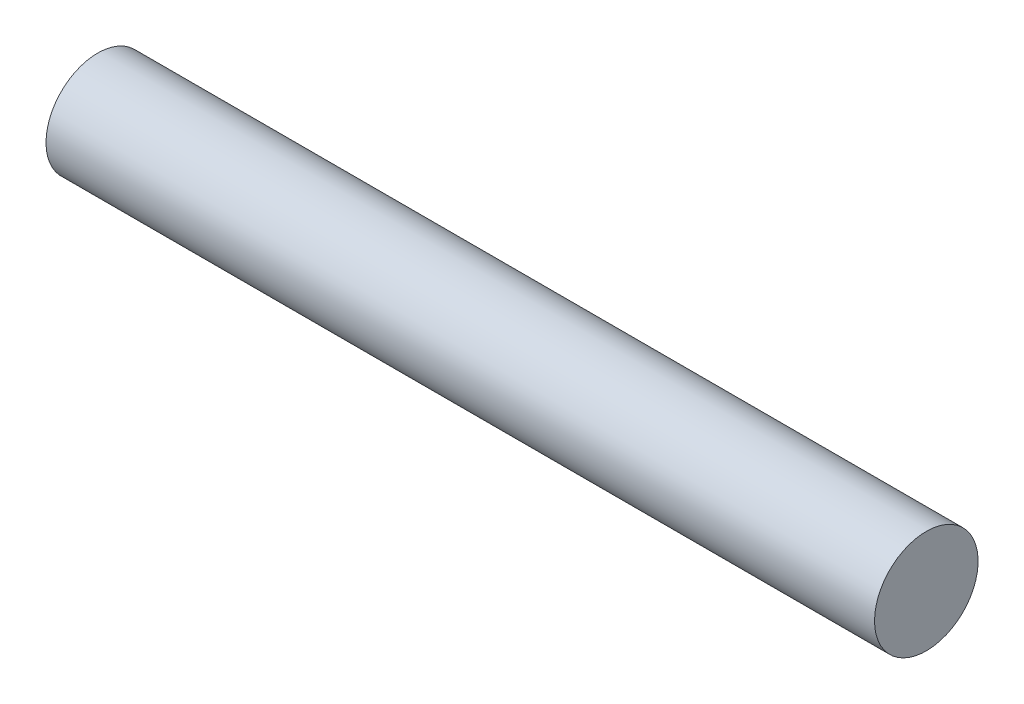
from build123d import *

# Parameters (mm, degrees)
BODYSKE_W = 80
BODYSKE_H = 5


with BuildPart() as part:
    # BodySke → BaseBody (revolve)
    with BuildSketch(Plane.XY, mode=Mode.PRIVATE) as basebody_sk:
        with Locations((40, 2.5)):
            Rectangle(BODYSKE_W, BODYSKE_H)
    revolve(basebody_sk.sketch.rotate(Axis((0, 0, 0), (1, 0, 0)), 90), axis=Axis((0, 0, 0), (1, 0, 0)))


solid = part.part
